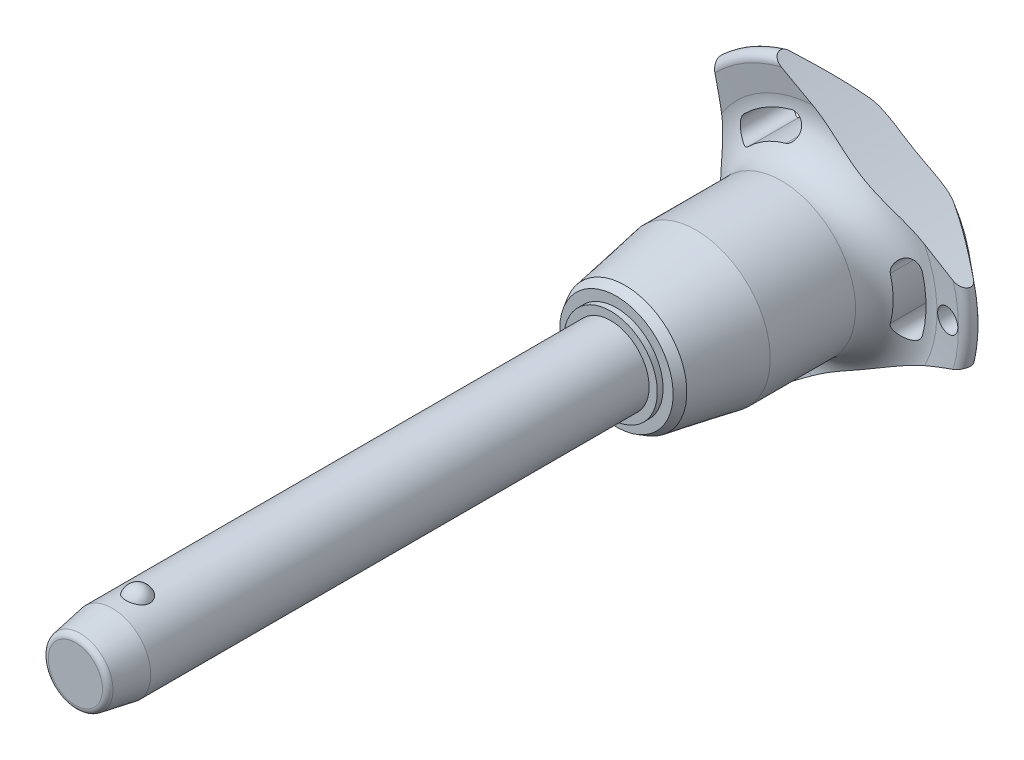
from build123d import *

# Parameters (mm, degrees)
SKETCH1_R           = 5
BOSS_EXTRUDE1_DEPTH = 60
SKETCH2_R           = 4.25
BOSS_EXTRUDE2_DEPTH = 33.3
BOSS_EXTRUDE3_START = 9.6
SKETCH1_2_R         = 5
BOSS_EXTRUDE3_DEPTH = 9.6
CHAMFER1_SIZE       = 4.8
CHAMFER1_SIZE2      = 0.846369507
FILLET1_R           = 0.75
SKETCH6_R           = 102.8
CUT_EXTRUDE1_DEPTH  = 98.333870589
CIRPATTERN1_COUNT   = 3
SKETCH7_R           = 1.5
CUT_EXTRUDE2_DEPTH  = 98.167560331


with BuildPart() as part:
    # Sketch1 → Boss-Extrude1 (new body)
    with BuildSketch(Plane.XY):
        Circle(SKETCH1_R)
    extrude(amount=-BOSS_EXTRUDE1_DEPTH)

    # Sketch2 → Boss-Extrude2 (add)
    with BuildSketch(Plane(origin=(0, 0, -60), x_dir=(-1, 0, 0), z_dir=(0, 0, -1))):
        Circle(SKETCH2_R)
    extrude(amount=BOSS_EXTRUDE2_DEPTH)

    # Sketch3 → Revolve1 (revolve)
    with BuildSketch(Plane(origin=(0, 0, 0), x_dir=(0, 0, -1), z_dir=(1, 0, 0))):
        with BuildLine():
            Line((-1.516575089, 6), (-1.516575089, 2.7))
            ThreePointArc((-1.516575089, 2.7), (0.133424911, 4.35), (-1.516575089, 6))
        make_face()
        with BuildLine():
            Line((-1.516575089, -2.7), (-1.516575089, -6))
            ThreePointArc((-1.516575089, -6), (0.133424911, -4.35), (-1.516575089, -2.7))
        make_face()
    revolve(axis=Axis((0, -2.7, 1.516575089), (0, 1, 0)))

    # Sketch1_2 → Boss-Extrude3 (add)
    with BuildSketch(Plane.XY.offset(BOSS_EXTRUDE3_START)):
        Circle(SKETCH1_2_R)
    extrude(amount=-BOSS_EXTRUDE3_DEPTH)

    # Chamfer1
    chamfer1_edges = [part.edges().sort_by_distance(p)[0] for p in [
        (-5, 0, 9.6),
    ]]
    chamfer1_side = [part.faces().sort_by_distance(p)[0] for p in [
        (-5, 0, -25.2),
    ]]
    chamfer(chamfer1_edges, length=CHAMFER1_SIZE, length2=CHAMFER1_SIZE2, reference=chamfer1_side[0])

    # Fillet1
    fillet1_edges = [part.edges().sort_by_distance(p)[0] for p in [
        (-4.153630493, 0, 9.6),
        (4.25, 0, -93.3),
    ]]
    fillet(fillet1_edges, radius=FILLET1_R)

    # Sketch4 → Revolve2 (revolve)
    with BuildSketch(Plane(origin=(0, 0, 0), x_dir=(0, 0, -1), z_dir=(1, 0, 0)), mode=Mode.PRIVATE) as revolve2_sk:
        Polygon((60, 0), (60, 6.067402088), (60.75, 6.067402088), (60.75, 7.371950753), (61.879772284, 8.024225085), (71.1, 9.65), (82.2, 9.65), (82.2, 0), align=None)
    revolve(revolve2_sk.sketch.rotate(Axis((0, 0, -82.2), (0, 0, 1)), 90), axis=Axis((0, 0, -82.2), (0, 0, 1)))

    # Sketch5 → Revolve3 (revolve)
    with BuildSketch(Plane(origin=(0, 0, 0), x_dir=(0, 0, -1), z_dir=(1, 0, 0)), mode=Mode.PRIVATE) as revolve3_sk:
        with BuildLine():
            Line((87.16082631, 15.274661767), (86.757834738, 18.475067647))
            ThreePointArc((86.757834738, 18.475067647), (87.349836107, 19.516443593), (88.516044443, 19.24278761))
            Line((88.516044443, 19.24278761), (92.835691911, 14.094832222))
            ThreePointArc((92.835691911, 14.094832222), (93.3, 12.689260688), (92.67067517, 11.349423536))
            ThreePointArc((92.67067517, 11.349423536), (89.033110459, 6.185112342), (87.75, 0))
            Line((87.75, 0), (82.2, 0))
            Line((82.2, 0), (82.2, 9.65))
            ThreePointArc((82.2, 9.65), (85.949887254, 11.342683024), (87.16082631, 15.274661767))
        make_face()
    revolve(revolve3_sk.sketch.rotate(Axis((0, 0, -87.75), (0, 0, 1)), 90), axis=Axis((0, 0, -87.75), (0, 0, 1)))

    # Sketch6 → Cut-Extrude1 (cut, through all)
    with BuildSketch(Plane.XY):
        with Locations((-115.2, 0)):
            Circle(SKETCH6_R)
        with BuildLine():
            ThreePointArc((13.411913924, -3.529271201), (13.868496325, 0), (13.411913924, 3.529271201))
            ThreePointArc((13.411913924, 3.529271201), (11.694200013, 4.531299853), (10.692171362, 2.813585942))
            ThreePointArc((10.692171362, 2.813585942), (11.056165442, 0), (10.692171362, -2.813585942))
            ThreePointArc((10.692171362, -2.813585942), (11.694200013, -4.531299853), (13.411913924, -3.529271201))
        make_face()
    cut_extrude1 = extrude(amount=-CUT_EXTRUDE1_DEPTH, mode=Mode.SUBTRACT)

    # CirPattern1: Cut-Extrude1 ×3 about axis
    cirpattern1_axis = Axis((0, 0, 0), (0, 0, 1))
    for i in range(1, CIRPATTERN1_COUNT):
        add(cut_extrude1.rotate(cirpattern1_axis, i * 360 / CIRPATTERN1_COUNT), mode=Mode.SUBTRACT)

    # Sketch7 → Cut-Extrude2 (cut, through all)
    with BuildSketch(Plane.XY):
        with Locations(Location((16.868496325, 0, 0), (0, 0, 225.467095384))):
            Circle(SKETCH7_R)
    extrude(amount=-CUT_EXTRUDE2_DEPTH, mode=Mode.SUBTRACT)


solid = part.part
